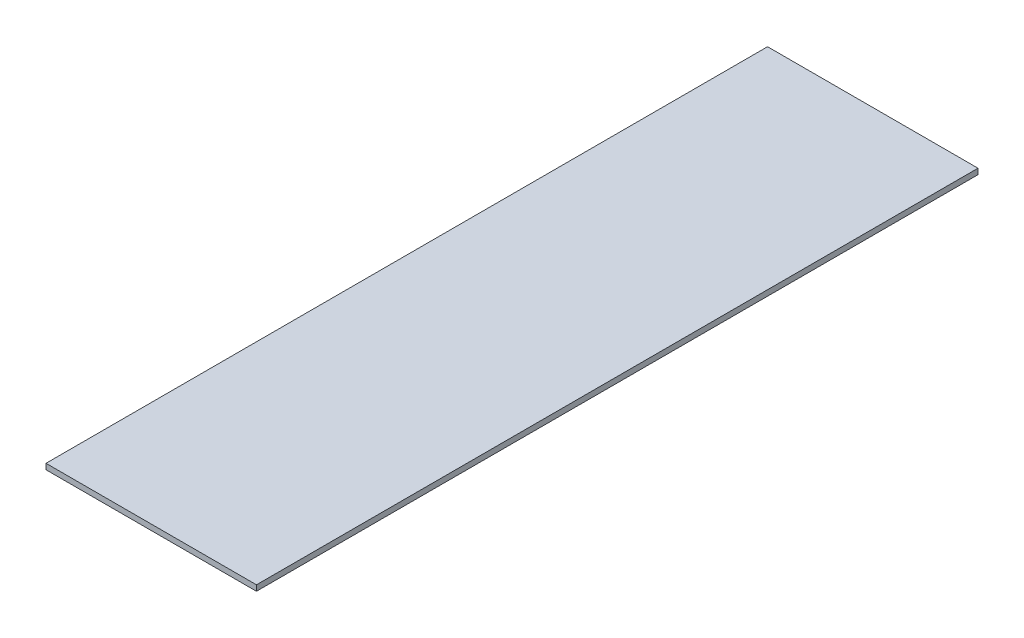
ISO-10303-21;
HEADER;
FILE_DESCRIPTION(('STEP AP214'),'2;1');
FILE_NAME('part.step','',(''),(''),'','','');
FILE_SCHEMA(('AUTOMOTIVE_DESIGN { 1 0 10303 214 1 1 1 1 }'));
ENDSEC;
DATA;
#1=APPLICATION_CONTEXT('core data for automotive mechanical design processes');
#2=APPLICATION_PROTOCOL_DEFINITION('international standard','automotive_design',2000,#1);
#3=PRODUCT_CONTEXT('',#1,'mechanical');
#4=PRODUCT('Part','Part','',(#3));
#5=PRODUCT_RELATED_PRODUCT_CATEGORY('part','',(#4));
#6=PRODUCT_DEFINITION_FORMATION('','',#4);
#7=PRODUCT_DEFINITION_CONTEXT('part definition',#1,'design');
#8=PRODUCT_DEFINITION('design','',#6,#7);
#9=PRODUCT_DEFINITION_SHAPE('','',#8);
#10=(LENGTH_UNIT() NAMED_UNIT(*) SI_UNIT(.MILLI.,.METRE.));
#11=(NAMED_UNIT(*) PLANE_ANGLE_UNIT() SI_UNIT($,.RADIAN.));
#12=(NAMED_UNIT(*) SI_UNIT($,.STERADIAN.) SOLID_ANGLE_UNIT());
#13=UNCERTAINTY_MEASURE_WITH_UNIT(LENGTH_MEASURE(1.E-05),#10,'distance_accuracy_value','');
#14=(GEOMETRIC_REPRESENTATION_CONTEXT(3) GLOBAL_UNCERTAINTY_ASSIGNED_CONTEXT((#13)) GLOBAL_UNIT_ASSIGNED_CONTEXT((#10,
#11,#12)) REPRESENTATION_CONTEXT('',''));
#15=CARTESIAN_POINT('',(0.,0.,0.));
#16=DIRECTION('',(0.,0.,1.));
#17=DIRECTION('',(1.,0.,0.));
#18=AXIS2_PLACEMENT_3D('',#15,#16,#17);
#19=CARTESIAN_POINT('',(177.8,4.7625,609.6));
#20=DIRECTION('',(-1.,0.,0.));
#21=DIRECTION('',(0.,0.,1.));
#22=AXIS2_PLACEMENT_3D('',#19,#20,#21);
#23=PLANE('',#22);
#24=DIRECTION('',(0.,0.,-1.));
#25=VECTOR('',#24,1.);
#26=CARTESIAN_POINT('',(177.8,-4.7625,609.6));
#27=LINE('',#26,#25);
#28=CARTESIAN_POINT('',(177.8,-4.7625,609.6));
#29=VERTEX_POINT('',#28);
#30=CARTESIAN_POINT('',(177.8,-4.7625,-609.6));
#31=VERTEX_POINT('',#30);
#32=EDGE_CURVE('E102',#29,#31,#27,.T.);
#33=ORIENTED_EDGE('',*,*,#32,.T.);
#34=DIRECTION('',(0.,-1.,0.));
#35=VECTOR('',#34,1.);
#36=CARTESIAN_POINT('',(177.8,4.7625,-609.6));
#37=LINE('',#36,#35);
#38=CARTESIAN_POINT('',(177.8,4.7625,-609.6));
#39=VERTEX_POINT('',#38);
#40=EDGE_CURVE('E11',#39,#31,#37,.T.);
#41=ORIENTED_EDGE('',*,*,#40,.F.);
#42=DIRECTION('',(0.,0.,-1.));
#43=VECTOR('',#42,1.);
#44=CARTESIAN_POINT('',(177.8,4.7625,609.6));
#45=LINE('',#44,#43);
#46=CARTESIAN_POINT('',(177.8,4.7625,609.6));
#47=VERTEX_POINT('',#46);
#48=EDGE_CURVE('E90',#47,#39,#45,.T.);
#49=ORIENTED_EDGE('',*,*,#48,.F.);
#50=DIRECTION('',(0.,-1.,0.));
#51=VECTOR('',#50,1.);
#52=CARTESIAN_POINT('',(177.8,4.7625,609.6));
#53=LINE('',#52,#51);
#54=EDGE_CURVE('E98',#47,#29,#53,.T.);
#55=ORIENTED_EDGE('',*,*,#54,.T.);
#56=EDGE_LOOP('',(#33,#41,#49,#55));
#57=FACE_BOUND('',#56,.T.);
#58=ADVANCED_FACE('F39',(#57),#23,.F.);
#59=CARTESIAN_POINT('',(-177.8,4.7625,-609.6));
#60=DIRECTION('',(0.,0.,1.));
#61=DIRECTION('',(1.,0.,0.));
#62=AXIS2_PLACEMENT_3D('',#59,#60,#61);
#63=PLANE('',#62);
#64=DIRECTION('',(-1.,0.,0.));
#65=VECTOR('',#64,1.);
#66=CARTESIAN_POINT('',(-177.8,-4.7625,-609.6));
#67=LINE('',#66,#65);
#68=CARTESIAN_POINT('',(-177.8,-4.7625,-609.6));
#69=VERTEX_POINT('',#68);
#70=EDGE_CURVE('E94',#31,#69,#67,.T.);
#71=ORIENTED_EDGE('',*,*,#70,.T.);
#72=DIRECTION('',(0.,-1.,0.));
#73=VECTOR('',#72,1.);
#74=CARTESIAN_POINT('',(-177.8,4.7625,-609.6));
#75=LINE('',#74,#73);
#76=CARTESIAN_POINT('',(-177.8,4.7625,-609.6));
#77=VERTEX_POINT('',#76);
#78=EDGE_CURVE('E47',#77,#69,#75,.T.);
#79=ORIENTED_EDGE('',*,*,#78,.F.);
#80=DIRECTION('',(-1.,0.,0.));
#81=VECTOR('',#80,1.);
#82=CARTESIAN_POINT('',(-177.8,4.7625,-609.6));
#83=LINE('',#82,#81);
#84=EDGE_CURVE('E85',#39,#77,#83,.T.);
#85=ORIENTED_EDGE('',*,*,#84,.F.);
#86=ORIENTED_EDGE('',*,*,#40,.T.);
#87=EDGE_LOOP('',(#71,#79,#85,#86));
#88=FACE_BOUND('',#87,.T.);
#89=ADVANCED_FACE('F93',(#88),#63,.F.);
#90=CARTESIAN_POINT('',(-177.8,4.7625,609.6));
#91=DIRECTION('',(1.,0.,0.));
#92=DIRECTION('',(0.,0.,-1.));
#93=AXIS2_PLACEMENT_3D('',#90,#91,#92);
#94=PLANE('',#93);
#95=DIRECTION('',(0.,0.,1.));
#96=VECTOR('',#95,1.);
#97=CARTESIAN_POINT('',(-177.8,-4.7625,609.6));
#98=LINE('',#97,#96);
#99=CARTESIAN_POINT('',(-177.8,-4.7625,609.6));
#100=VERTEX_POINT('',#99);
#101=EDGE_CURVE('E72',#69,#100,#98,.T.);
#102=ORIENTED_EDGE('',*,*,#101,.T.);
#103=DIRECTION('',(0.,-1.,0.));
#104=VECTOR('',#103,1.);
#105=CARTESIAN_POINT('',(-177.8,4.7625,609.6));
#106=LINE('',#105,#104);
#107=CARTESIAN_POINT('',(-177.8,4.7625,609.6));
#108=VERTEX_POINT('',#107);
#109=EDGE_CURVE('E95',#108,#100,#106,.T.);
#110=ORIENTED_EDGE('',*,*,#109,.F.);
#111=DIRECTION('',(0.,0.,1.));
#112=VECTOR('',#111,1.);
#113=CARTESIAN_POINT('',(-177.8,4.7625,609.6));
#114=LINE('',#113,#112);
#115=EDGE_CURVE('E88',#77,#108,#114,.T.);
#116=ORIENTED_EDGE('',*,*,#115,.F.);
#117=ORIENTED_EDGE('',*,*,#78,.T.);
#118=EDGE_LOOP('',(#102,#110,#116,#117));
#119=FACE_BOUND('',#118,.T.);
#120=ADVANCED_FACE('F96',(#119),#94,.F.);
#121=CARTESIAN_POINT('',(-177.8,4.7625,609.6));
#122=DIRECTION('',(0.,0.,-1.));
#123=DIRECTION('',(-1.,0.,0.));
#124=AXIS2_PLACEMENT_3D('',#121,#122,#123);
#125=PLANE('',#124);
#126=DIRECTION('',(1.,0.,0.));
#127=VECTOR('',#126,1.);
#128=CARTESIAN_POINT('',(-177.8,-4.7625,609.6));
#129=LINE('',#128,#127);
#130=EDGE_CURVE('E78',#100,#29,#129,.T.);
#131=ORIENTED_EDGE('',*,*,#130,.T.);
#132=ORIENTED_EDGE('',*,*,#54,.F.);
#133=DIRECTION('',(1.,0.,0.));
#134=VECTOR('',#133,1.);
#135=CARTESIAN_POINT('',(-177.8,4.7625,609.6));
#136=LINE('',#135,#134);
#137=EDGE_CURVE('E55',#108,#47,#136,.T.);
#138=ORIENTED_EDGE('',*,*,#137,.F.);
#139=ORIENTED_EDGE('',*,*,#109,.T.);
#140=EDGE_LOOP('',(#131,#132,#138,#139));
#141=FACE_BOUND('',#140,.T.);
#142=ADVANCED_FACE('F109',(#141),#125,.F.);
#143=CARTESIAN_POINT('',(0.,4.7625,0.));
#144=DIRECTION('',(0.,-1.,0.));
#145=DIRECTION('',(0.,0.,-1.));
#146=AXIS2_PLACEMENT_3D('',#143,#144,#145);
#147=PLANE('',#146);
#148=ORIENTED_EDGE('',*,*,#48,.T.);
#149=ORIENTED_EDGE('',*,*,#84,.T.);
#150=ORIENTED_EDGE('',*,*,#115,.T.);
#151=ORIENTED_EDGE('',*,*,#137,.T.);
#152=EDGE_LOOP('',(#148,#149,#150,#151));
#153=FACE_BOUND('',#152,.T.);
#154=ADVANCED_FACE('F86',(#153),#147,.F.);
#155=CARTESIAN_POINT('',(0.,-4.7625,0.));
#156=DIRECTION('',(0.,-1.,0.));
#157=DIRECTION('',(0.,0.,-1.));
#158=AXIS2_PLACEMENT_3D('',#155,#156,#157);
#159=PLANE('',#158);
#160=ORIENTED_EDGE('',*,*,#32,.F.);
#161=ORIENTED_EDGE('',*,*,#130,.F.);
#162=ORIENTED_EDGE('',*,*,#101,.F.);
#163=ORIENTED_EDGE('',*,*,#70,.F.);
#164=EDGE_LOOP('',(#160,#161,#162,#163));
#165=FACE_BOUND('',#164,.T.);
#166=ADVANCED_FACE('F112',(#165),#159,.T.);
#167=CLOSED_SHELL('',(#58,#89,#120,#142,#154,#166));
#168=MANIFOLD_SOLID_BREP('B2',#167);
#169=ADVANCED_BREP_SHAPE_REPRESENTATION('',(#18,#168),#14);
#170=SHAPE_DEFINITION_REPRESENTATION(#9,#169);
ENDSEC;
END-ISO-10303-21;
